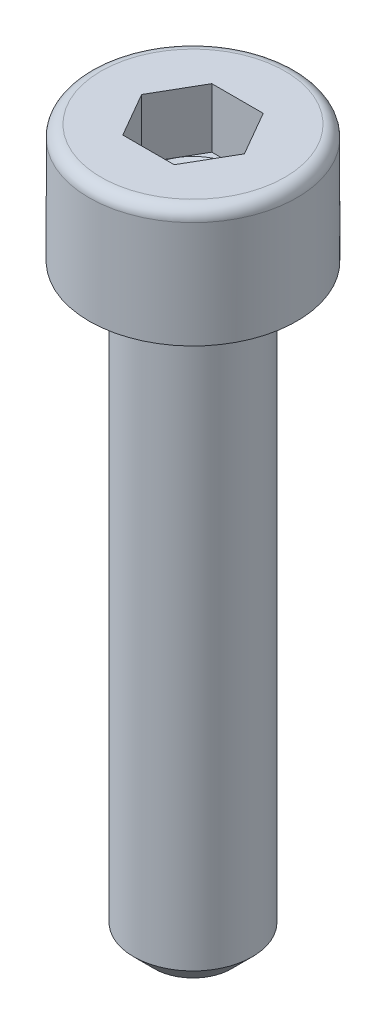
ISO-10303-21;
HEADER;
FILE_DESCRIPTION(('STEP AP214'),'2;1');
FILE_NAME('part.step','',(''),(''),'','','');
FILE_SCHEMA(('AUTOMOTIVE_DESIGN { 1 0 10303 214 1 1 1 1 }'));
ENDSEC;
DATA;
#1=APPLICATION_CONTEXT('core data for automotive mechanical design processes');
#2=APPLICATION_PROTOCOL_DEFINITION('international standard','automotive_design',2000,#1);
#3=PRODUCT_CONTEXT('',#1,'mechanical');
#4=PRODUCT('Part','Part','',(#3));
#5=PRODUCT_RELATED_PRODUCT_CATEGORY('part','',(#4));
#6=PRODUCT_DEFINITION_FORMATION('','',#4);
#7=PRODUCT_DEFINITION_CONTEXT('part definition',#1,'design');
#8=PRODUCT_DEFINITION('design','',#6,#7);
#9=PRODUCT_DEFINITION_SHAPE('','',#8);
#10=(LENGTH_UNIT() NAMED_UNIT(*) SI_UNIT(.MILLI.,.METRE.));
#11=(NAMED_UNIT(*) PLANE_ANGLE_UNIT() SI_UNIT($,.RADIAN.));
#12=(NAMED_UNIT(*) SI_UNIT($,.STERADIAN.) SOLID_ANGLE_UNIT());
#13=UNCERTAINTY_MEASURE_WITH_UNIT(LENGTH_MEASURE(1.E-05),#10,'distance_accuracy_value','');
#14=(GEOMETRIC_REPRESENTATION_CONTEXT(3) GLOBAL_UNCERTAINTY_ASSIGNED_CONTEXT((#13)) GLOBAL_UNIT_ASSIGNED_CONTEXT((#10,
#11,#12)) REPRESENTATION_CONTEXT('',''));
#15=CARTESIAN_POINT('',(0.,0.,0.));
#16=DIRECTION('',(0.,0.,1.));
#17=DIRECTION('',(1.,0.,0.));
#18=AXIS2_PLACEMENT_3D('',#15,#16,#17);
#19=CARTESIAN_POINT('',(-2.598076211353,2.,1.5));
#20=DIRECTION('',(0.,-1.,0.));
#21=DIRECTION('',(0.,0.,-1.));
#22=AXIS2_PLACEMENT_3D('',#19,#20,#21);
#23=PLANE('',#22);
#24=CARTESIAN_POINT('',(0.,2.00000000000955,0.));
#25=DIRECTION('',(0.,1.,0.));
#26=DIRECTION('',(0.,0.,1.));
#27=AXIS2_PLACEMENT_3D('',#24,#25,#26);
#28=CIRCLE('',#27,1.49999999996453);
#29=CARTESIAN_POINT('',(-1.29903810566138,2.00000000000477,-0.74999999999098));
#30=VERTEX_POINT('',#29);
#31=CARTESIAN_POINT('',(0.,2.00000000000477,-1.49999999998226));
#32=VERTEX_POINT('',#31);
#33=EDGE_CURVE('E109',#30,#32,#28,.F.);
#34=ORIENTED_EDGE('',*,*,#33,.T.);
#35=DIRECTION('',(1.,0.,0.));
#36=VECTOR('',#35,1.);
#37=CARTESIAN_POINT('',(0.8660254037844,2.,-1.5));
#38=LINE('',#37,#36);
#39=CARTESIAN_POINT('',(-0.8660254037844,2.,-1.5));
#40=VERTEX_POINT('',#39);
#41=EDGE_CURVE('E120',#40,#32,#38,.T.);
#42=ORIENTED_EDGE('',*,*,#41,.F.);
#43=DIRECTION('',(0.500000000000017,0.,-0.866025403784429));
#44=VECTOR('',#43,1.);
#45=CARTESIAN_POINT('',(-0.8660254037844,2.,-1.5));
#46=LINE('',#45,#44);
#47=EDGE_CURVE('E119',#30,#40,#46,.T.);
#48=ORIENTED_EDGE('',*,*,#47,.F.);
#49=EDGE_LOOP('',(#34,#42,#48));
#50=FACE_BOUND('',#49,.T.);
#51=ADVANCED_FACE('F17',(#50),#23,.F.);
#52=CARTESIAN_POINT('',(-2.598076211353,2.,1.5));
#53=DIRECTION('',(0.,-1.,0.));
#54=DIRECTION('',(0.,0.,-1.));
#55=AXIS2_PLACEMENT_3D('',#52,#53,#54);
#56=PLANE('',#55);
#57=CARTESIAN_POINT('',(0.,2.00000000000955,0.));
#58=DIRECTION('',(0.,1.,0.));
#59=DIRECTION('',(0.,0.,1.));
#60=AXIS2_PLACEMENT_3D('',#57,#58,#59);
#61=CIRCLE('',#60,1.49999999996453);
#62=CARTESIAN_POINT('',(-1.29903810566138,2.00000000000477,0.74999999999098));
#63=VERTEX_POINT('',#62);
#64=EDGE_CURVE('E93',#63,#30,#61,.F.);
#65=ORIENTED_EDGE('',*,*,#64,.T.);
#66=DIRECTION('',(0.500000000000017,0.,-0.866025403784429));
#67=VECTOR('',#66,1.);
#68=CARTESIAN_POINT('',(-0.8660254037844,2.,-1.5));
#69=LINE('',#68,#67);
#70=CARTESIAN_POINT('',(-1.73205080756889,2.,0.));
#71=VERTEX_POINT('',#70);
#72=EDGE_CURVE('E97',#71,#30,#69,.T.);
#73=ORIENTED_EDGE('',*,*,#72,.F.);
#74=DIRECTION('',(-0.500000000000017,0.,-0.866025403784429));
#75=VECTOR('',#74,1.);
#76=CARTESIAN_POINT('',(-0.8660254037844,2.,1.5));
#77=LINE('',#76,#75);
#78=EDGE_CURVE('E100',#63,#71,#77,.T.);
#79=ORIENTED_EDGE('',*,*,#78,.F.);
#80=EDGE_LOOP('',(#65,#73,#79));
#81=FACE_BOUND('',#80,.T.);
#82=ADVANCED_FACE('F95',(#81),#56,.F.);
#83=CARTESIAN_POINT('',(-0.8660254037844,2.,-1.5));
#84=DIRECTION('',(0.866025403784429,0.,0.500000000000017));
#85=DIRECTION('',(0.500000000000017,0.,-0.866025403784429));
#86=AXIS2_PLACEMENT_3D('',#83,#84,#85);
#87=PLANE('',#86);
#88=DIRECTION('',(0.,1.,0.));
#89=VECTOR('',#88,1.);
#90=CARTESIAN_POINT('',(-0.8660254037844,2.,-1.5));
#91=LINE('',#90,#89);
#92=CARTESIAN_POINT('',(-0.8660254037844,4.,-1.5));
#93=VERTEX_POINT('',#92);
#94=EDGE_CURVE('E138',#93,#40,#91,.F.);
#95=ORIENTED_EDGE('',*,*,#94,.F.);
#96=DIRECTION('',(0.500000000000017,0.,-0.866025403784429));
#97=VECTOR('',#96,1.);
#98=CARTESIAN_POINT('',(-0.8660254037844,4.,-1.5));
#99=LINE('',#98,#97);
#100=CARTESIAN_POINT('',(-1.7320508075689,4.,0.));
#101=VERTEX_POINT('',#100);
#102=EDGE_CURVE('E124',#93,#101,#99,.F.);
#103=ORIENTED_EDGE('',*,*,#102,.T.);
#104=DIRECTION('',(0.,1.,0.));
#105=VECTOR('',#104,1.);
#106=CARTESIAN_POINT('',(-1.73205080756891,2.,0.));
#107=LINE('',#106,#105);
#108=EDGE_CURVE('E128',#71,#101,#107,.T.);
#109=ORIENTED_EDGE('',*,*,#108,.F.);
#110=ORIENTED_EDGE('',*,*,#72,.T.);
#111=ORIENTED_EDGE('',*,*,#47,.T.);
#112=EDGE_LOOP('',(#95,#103,#109,#110,#111));
#113=FACE_BOUND('',#112,.T.);
#114=ADVANCED_FACE('F126',(#113),#87,.T.);
#115=CARTESIAN_POINT('',(0.8660254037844,2.,-1.5));
#116=DIRECTION('',(0.,0.,1.));
#117=DIRECTION('',(1.,0.,0.));
#118=AXIS2_PLACEMENT_3D('',#115,#116,#117);
#119=PLANE('',#118);
#120=DIRECTION('',(0.,1.,0.));
#121=VECTOR('',#120,1.);
#122=CARTESIAN_POINT('',(0.8660254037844,2.,-1.5));
#123=LINE('',#122,#121);
#124=CARTESIAN_POINT('',(0.8660254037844,4.,-1.5));
#125=VERTEX_POINT('',#124);
#126=CARTESIAN_POINT('',(0.8660254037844,2.,-1.5));
#127=VERTEX_POINT('',#126);
#128=EDGE_CURVE('E152',#125,#127,#123,.F.);
#129=ORIENTED_EDGE('',*,*,#128,.F.);
#130=DIRECTION('',(1.,0.,0.));
#131=VECTOR('',#130,1.);
#132=CARTESIAN_POINT('',(0.8660254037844,4.,-1.5));
#133=LINE('',#132,#131);
#134=EDGE_CURVE('E137',#125,#93,#133,.F.);
#135=ORIENTED_EDGE('',*,*,#134,.T.);
#136=ORIENTED_EDGE('',*,*,#94,.T.);
#137=ORIENTED_EDGE('',*,*,#41,.T.);
#138=DIRECTION('',(1.,0.,0.));
#139=VECTOR('',#138,1.);
#140=CARTESIAN_POINT('',(-2.598076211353,2.,-1.5));
#141=LINE('',#140,#139);
#142=EDGE_CURVE('E105',#32,#127,#141,.T.);
#143=ORIENTED_EDGE('',*,*,#142,.T.);
#144=EDGE_LOOP('',(#129,#135,#136,#137,#143));
#145=FACE_BOUND('',#144,.T.);
#146=ADVANCED_FACE('F306',(#145),#119,.T.);
#147=CARTESIAN_POINT('',(-2.598076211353,2.,1.5));
#148=DIRECTION('',(0.,-1.,0.));
#149=DIRECTION('',(0.,0.,-1.));
#150=AXIS2_PLACEMENT_3D('',#147,#148,#149);
#151=PLANE('',#150);
#152=CARTESIAN_POINT('',(0.,2.00000000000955,0.));
#153=DIRECTION('',(0.,1.,0.));
#154=DIRECTION('',(0.,0.,1.));
#155=AXIS2_PLACEMENT_3D('',#152,#153,#154);
#156=CIRCLE('',#155,1.49999999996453);
#157=CARTESIAN_POINT('',(1.29903810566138,2.00000000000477,-0.74999999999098));
#158=VERTEX_POINT('',#157);
#159=EDGE_CURVE('E114',#158,#32,#156,.T.);
#160=ORIENTED_EDGE('',*,*,#159,.F.);
#161=DIRECTION('',(0.500000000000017,0.,0.866025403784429));
#162=VECTOR('',#161,1.);
#163=CARTESIAN_POINT('',(0.8660254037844,2.,-1.5));
#164=LINE('',#163,#162);
#165=EDGE_CURVE('E245',#127,#158,#164,.T.);
#166=ORIENTED_EDGE('',*,*,#165,.F.);
#167=ORIENTED_EDGE('',*,*,#142,.F.);
#168=EDGE_LOOP('',(#160,#166,#167));
#169=FACE_BOUND('',#168,.T.);
#170=ADVANCED_FACE('F301',(#169),#151,.F.);
#171=CARTESIAN_POINT('',(0.,2.00000000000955,0.));
#172=DIRECTION('',(0.,1.,0.));
#173=DIRECTION('',(0.,0.,1.));
#174=AXIS2_PLACEMENT_3D('',#171,#172,#173);
#175=CONICAL_SURFACE('',#174,1.49999999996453,1.04719755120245);
#176=CARTESIAN_POINT('',(0.,2.00000000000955,0.));
#177=DIRECTION('',(0.,1.,0.));
#178=DIRECTION('',(0.,0.,1.));
#179=AXIS2_PLACEMENT_3D('',#176,#177,#178);
#180=CIRCLE('',#179,1.49999999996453);
#181=CARTESIAN_POINT('',(1.29903810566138,2.00000000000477,0.74999999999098));
#182=VERTEX_POINT('',#181);
#183=EDGE_CURVE('E166',#182,#158,#180,.T.);
#184=ORIENTED_EDGE('',*,*,#183,.T.);
#185=ORIENTED_EDGE('',*,*,#159,.T.);
#186=ORIENTED_EDGE('',*,*,#33,.F.);
#187=ORIENTED_EDGE('',*,*,#64,.F.);
#188=CARTESIAN_POINT('',(0.,2.00000000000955,0.));
#189=DIRECTION('',(0.,1.,0.));
#190=DIRECTION('',(0.,0.,1.));
#191=AXIS2_PLACEMENT_3D('',#188,#189,#190);
#192=CIRCLE('',#191,1.49999999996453);
#193=CARTESIAN_POINT('',(0.,2.00000000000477,1.49999999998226));
#194=VERTEX_POINT('',#193);
#195=EDGE_CURVE('E104',#63,#194,#192,.T.);
#196=ORIENTED_EDGE('',*,*,#195,.T.);
#197=CARTESIAN_POINT('',(0.,2.00000000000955,0.));
#198=DIRECTION('',(0.,1.,0.));
#199=DIRECTION('',(0.,0.,1.));
#200=AXIS2_PLACEMENT_3D('',#197,#198,#199);
#201=CIRCLE('',#200,1.49999999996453);
#202=EDGE_CURVE('E162',#194,#182,#201,.T.);
#203=ORIENTED_EDGE('',*,*,#202,.T.);
#204=EDGE_LOOP('',(#184,#185,#186,#187,#196,#203));
#205=FACE_BOUND('',#204,.T.);
#206=CARTESIAN_POINT('',(0.,1.1339745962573,0.));
#207=VERTEX_POINT('',#206);
#208=VERTEX_LOOP('',#207);
#209=FACE_BOUND('',#208,.T.);
#210=ADVANCED_FACE('F111',(#205,#209),#175,.F.);
#211=CARTESIAN_POINT('',(-2.598076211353,2.,1.5));
#212=DIRECTION('',(0.,-1.,0.));
#213=DIRECTION('',(0.,0.,-1.));
#214=AXIS2_PLACEMENT_3D('',#211,#212,#213);
#215=PLANE('',#214);
#216=ORIENTED_EDGE('',*,*,#195,.F.);
#217=DIRECTION('',(-0.500000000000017,0.,-0.866025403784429));
#218=VECTOR('',#217,1.);
#219=CARTESIAN_POINT('',(-0.8660254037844,2.,1.5));
#220=LINE('',#219,#218);
#221=CARTESIAN_POINT('',(-0.8660254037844,2.,1.5));
#222=VERTEX_POINT('',#221);
#223=EDGE_CURVE('E169',#222,#63,#220,.T.);
#224=ORIENTED_EDGE('',*,*,#223,.F.);
#225=DIRECTION('',(-1.,0.,0.));
#226=VECTOR('',#225,1.);
#227=CARTESIAN_POINT('',(0.8660254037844,2.,1.5));
#228=LINE('',#227,#226);
#229=EDGE_CURVE('E235',#194,#222,#228,.T.);
#230=ORIENTED_EDGE('',*,*,#229,.F.);
#231=EDGE_LOOP('',(#216,#224,#230));
#232=FACE_BOUND('',#231,.T.);
#233=ADVANCED_FACE('F285',(#232),#215,.F.);
#234=CARTESIAN_POINT('',(-0.8660254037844,2.,1.5));
#235=DIRECTION('',(0.866025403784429,0.,-0.500000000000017));
#236=DIRECTION('',(-0.500000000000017,0.,-0.866025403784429));
#237=AXIS2_PLACEMENT_3D('',#234,#235,#236);
#238=PLANE('',#237);
#239=ORIENTED_EDGE('',*,*,#108,.T.);
#240=DIRECTION('',(-0.500000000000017,0.,-0.866025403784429));
#241=VECTOR('',#240,1.);
#242=CARTESIAN_POINT('',(-0.8660254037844,4.,1.5));
#243=LINE('',#242,#241);
#244=CARTESIAN_POINT('',(-0.8660254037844,4.,1.5));
#245=VERTEX_POINT('',#244);
#246=EDGE_CURVE('E149',#101,#245,#243,.F.);
#247=ORIENTED_EDGE('',*,*,#246,.T.);
#248=DIRECTION('',(0.,1.,0.));
#249=VECTOR('',#248,1.);
#250=CARTESIAN_POINT('',(-0.8660254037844,2.,1.5));
#251=LINE('',#250,#249);
#252=EDGE_CURVE('E254',#222,#245,#251,.T.);
#253=ORIENTED_EDGE('',*,*,#252,.F.);
#254=ORIENTED_EDGE('',*,*,#223,.T.);
#255=ORIENTED_EDGE('',*,*,#78,.T.);
#256=EDGE_LOOP('',(#239,#247,#253,#254,#255));
#257=FACE_BOUND('',#256,.T.);
#258=ADVANCED_FACE('F279',(#257),#238,.T.);
#259=CARTESIAN_POINT('',(0.8660254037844,2.,-1.5));
#260=DIRECTION('',(-0.866025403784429,0.,0.500000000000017));
#261=DIRECTION('',(0.500000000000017,0.,0.866025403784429));
#262=AXIS2_PLACEMENT_3D('',#259,#260,#261);
#263=PLANE('',#262);
#264=DIRECTION('',(0.,1.,0.));
#265=VECTOR('',#264,1.);
#266=CARTESIAN_POINT('',(1.73205080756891,2.,0.));
#267=LINE('',#266,#265);
#268=CARTESIAN_POINT('',(1.73205080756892,4.,0.));
#269=VERTEX_POINT('',#268);
#270=CARTESIAN_POINT('',(1.73205080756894,2.,0.));
#271=VERTEX_POINT('',#270);
#272=EDGE_CURVE('E221',#269,#271,#267,.F.);
#273=ORIENTED_EDGE('',*,*,#272,.F.);
#274=DIRECTION('',(0.500000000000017,0.,0.866025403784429));
#275=VECTOR('',#274,1.);
#276=CARTESIAN_POINT('',(0.8660254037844,4.,-1.5));
#277=LINE('',#276,#275);
#278=EDGE_CURVE('E168',#269,#125,#277,.F.);
#279=ORIENTED_EDGE('',*,*,#278,.T.);
#280=ORIENTED_EDGE('',*,*,#128,.T.);
#281=ORIENTED_EDGE('',*,*,#165,.T.);
#282=DIRECTION('',(0.49999999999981,0.,0.866025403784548));
#283=VECTOR('',#282,1.);
#284=CARTESIAN_POINT('',(1.299038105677,2.,-0.75));
#285=LINE('',#284,#283);
#286=EDGE_CURVE('E165',#158,#271,#285,.T.);
#287=ORIENTED_EDGE('',*,*,#286,.T.);
#288=EDGE_LOOP('',(#273,#279,#280,#281,#287));
#289=FACE_BOUND('',#288,.T.);
#290=ADVANCED_FACE('F303',(#289),#263,.T.);
#291=CARTESIAN_POINT('',(-2.598076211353,2.,1.5));
#292=DIRECTION('',(0.,-1.,0.));
#293=DIRECTION('',(0.,0.,-1.));
#294=AXIS2_PLACEMENT_3D('',#291,#292,#293);
#295=PLANE('',#294);
#296=ORIENTED_EDGE('',*,*,#286,.F.);
#297=ORIENTED_EDGE('',*,*,#183,.F.);
#298=DIRECTION('',(-0.500000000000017,0.,0.866025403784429));
#299=VECTOR('',#298,1.);
#300=CARTESIAN_POINT('',(0.8660254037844,2.,1.5));
#301=LINE('',#300,#299);
#302=EDGE_CURVE('E212',#271,#182,#301,.T.);
#303=ORIENTED_EDGE('',*,*,#302,.F.);
#304=EDGE_LOOP('',(#296,#297,#303));
#305=FACE_BOUND('',#304,.T.);
#306=ADVANCED_FACE('F297',(#305),#295,.F.);
#307=CARTESIAN_POINT('',(-2.598076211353,2.,1.5));
#308=DIRECTION('',(0.,-1.,0.));
#309=DIRECTION('',(0.,0.,-1.));
#310=AXIS2_PLACEMENT_3D('',#307,#308,#309);
#311=PLANE('',#310);
#312=ORIENTED_EDGE('',*,*,#202,.F.);
#313=DIRECTION('',(-1.,0.,0.));
#314=VECTOR('',#313,1.);
#315=CARTESIAN_POINT('',(0.8660254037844,2.,1.5));
#316=LINE('',#315,#314);
#317=CARTESIAN_POINT('',(0.8660254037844,2.,1.5));
#318=VERTEX_POINT('',#317);
#319=EDGE_CURVE('E164',#318,#194,#316,.T.);
#320=ORIENTED_EDGE('',*,*,#319,.F.);
#321=DIRECTION('',(-0.500000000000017,0.,0.866025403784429));
#322=VECTOR('',#321,1.);
#323=CARTESIAN_POINT('',(0.8660254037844,2.,1.5));
#324=LINE('',#323,#322);
#325=EDGE_CURVE('E220',#182,#318,#324,.T.);
#326=ORIENTED_EDGE('',*,*,#325,.F.);
#327=EDGE_LOOP('',(#312,#320,#326));
#328=FACE_BOUND('',#327,.T.);
#329=ADVANCED_FACE('F290',(#328),#311,.F.);
#330=CARTESIAN_POINT('',(0.8660254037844,2.,1.5));
#331=DIRECTION('',(0.,0.,-1.));
#332=DIRECTION('',(-1.,0.,0.));
#333=AXIS2_PLACEMENT_3D('',#330,#331,#332);
#334=PLANE('',#333);
#335=ORIENTED_EDGE('',*,*,#252,.T.);
#336=DIRECTION('',(-1.,0.,0.));
#337=VECTOR('',#336,1.);
#338=CARTESIAN_POINT('',(0.8660254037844,4.,1.5));
#339=LINE('',#338,#337);
#340=CARTESIAN_POINT('',(0.8660254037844,4.,1.5));
#341=VERTEX_POINT('',#340);
#342=EDGE_CURVE('E240',#245,#341,#339,.F.);
#343=ORIENTED_EDGE('',*,*,#342,.T.);
#344=DIRECTION('',(0.,1.,0.));
#345=VECTOR('',#344,1.);
#346=CARTESIAN_POINT('',(0.8660254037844,2.,1.5));
#347=LINE('',#346,#345);
#348=EDGE_CURVE('E226',#318,#341,#347,.T.);
#349=ORIENTED_EDGE('',*,*,#348,.F.);
#350=ORIENTED_EDGE('',*,*,#319,.T.);
#351=ORIENTED_EDGE('',*,*,#229,.T.);
#352=EDGE_LOOP('',(#335,#343,#349,#350,#351));
#353=FACE_BOUND('',#352,.T.);
#354=ADVANCED_FACE('F316',(#353),#334,.T.);
#355=CARTESIAN_POINT('',(0.8660254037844,2.,1.5));
#356=DIRECTION('',(-0.866025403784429,0.,-0.500000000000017));
#357=DIRECTION('',(-0.500000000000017,0.,0.866025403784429));
#358=AXIS2_PLACEMENT_3D('',#355,#356,#357);
#359=PLANE('',#358);
#360=ORIENTED_EDGE('',*,*,#348,.T.);
#361=DIRECTION('',(0.50000000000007,0.,-0.866025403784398));
#362=VECTOR('',#361,1.);
#363=CARTESIAN_POINT('',(0.8660254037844,4.,1.5));
#364=LINE('',#363,#362);
#365=EDGE_CURVE('E176',#341,#269,#364,.T.);
#366=ORIENTED_EDGE('',*,*,#365,.T.);
#367=ORIENTED_EDGE('',*,*,#272,.T.);
#368=ORIENTED_EDGE('',*,*,#302,.T.);
#369=ORIENTED_EDGE('',*,*,#325,.T.);
#370=EDGE_LOOP('',(#360,#366,#367,#368,#369));
#371=FACE_BOUND('',#370,.T.);
#372=ADVANCED_FACE('F197',(#371),#359,.T.);
#373=CARTESIAN_POINT('',(1.5,4.,0.));
#374=DIRECTION('',(0.,-1.,0.));
#375=DIRECTION('',(0.,0.,-1.));
#376=AXIS2_PLACEMENT_3D('',#373,#374,#375);
#377=PLANE('',#376);
#378=ORIENTED_EDGE('',*,*,#342,.F.);
#379=ORIENTED_EDGE('',*,*,#246,.F.);
#380=ORIENTED_EDGE('',*,*,#102,.F.);
#381=ORIENTED_EDGE('',*,*,#134,.F.);
#382=ORIENTED_EDGE('',*,*,#278,.F.);
#383=ORIENTED_EDGE('',*,*,#365,.F.);
#384=EDGE_LOOP('',(#378,#379,#380,#381,#382,#383));
#385=FACE_BOUND('',#384,.T.);
#386=CARTESIAN_POINT('',(0.,4.,0.));
#387=DIRECTION('',(0.,-1.,0.));
#388=DIRECTION('',(1.,0.,0.));
#389=AXIS2_PLACEMENT_3D('',#386,#387,#388);
#390=CIRCLE('',#389,3.1);
#391=CARTESIAN_POINT('',(3.1,4.,0.));
#392=VERTEX_POINT('',#391);
#393=CARTESIAN_POINT('',(-3.1,4.,0.));
#394=VERTEX_POINT('',#393);
#395=EDGE_CURVE('E37',#392,#394,#390,.T.);
#396=ORIENTED_EDGE('',*,*,#395,.F.);
#397=CARTESIAN_POINT('',(0.,4.,0.));
#398=DIRECTION('',(0.,-1.,0.));
#399=DIRECTION('',(-1.,0.,0.));
#400=AXIS2_PLACEMENT_3D('',#397,#398,#399);
#401=CIRCLE('',#400,3.1);
#402=EDGE_CURVE('E174',#394,#392,#401,.T.);
#403=ORIENTED_EDGE('',*,*,#402,.F.);
#404=EDGE_LOOP('',(#396,#403));
#405=FACE_BOUND('',#404,.T.);
#406=ADVANCED_FACE('F178',(#385,#405),#377,.F.);
#407=CARTESIAN_POINT('',(0.,3.6,0.));
#408=DIRECTION('',(0.,1.,0.));
#409=DIRECTION('',(-1.,0.,0.));
#410=AXIS2_PLACEMENT_3D('',#407,#408,#409);
#411=TOROIDAL_SURFACE('',#410,3.1,0.4);
#412=ORIENTED_EDGE('',*,*,#395,.T.);
#413=ORIENTED_EDGE('',*,*,#402,.T.);
#414=EDGE_LOOP('',(#412,#413));
#415=FACE_BOUND('',#414,.T.);
#416=CARTESIAN_POINT('',(0.,3.6,0.));
#417=DIRECTION('',(0.,1.,0.));
#418=DIRECTION('',(0.,0.,1.));
#419=AXIS2_PLACEMENT_3D('',#416,#417,#418);
#420=CIRCLE('',#419,3.5);
#421=CARTESIAN_POINT('',(0.,3.6,3.5));
#422=VERTEX_POINT('',#421);
#423=EDGE_CURVE('E161',#422,#422,#420,.F.);
#424=ORIENTED_EDGE('',*,*,#423,.F.);
#425=EDGE_LOOP('',(#424));
#426=FACE_BOUND('',#425,.T.);
#427=ADVANCED_FACE('F172',(#415,#426),#411,.T.);
#428=CARTESIAN_POINT('',(0.,-20.,0.));
#429=DIRECTION('',(0.,1.,0.));
#430=DIRECTION('',(0.,0.,1.));
#431=AXIS2_PLACEMENT_3D('',#428,#429,#430);
#432=PLANE('',#431);
#433=CARTESIAN_POINT('',(0.,-20.0000000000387,0.));
#434=DIRECTION('',(0.,1.,0.));
#435=DIRECTION('',(0.,0.,1.));
#436=AXIS2_PLACEMENT_3D('',#433,#434,#435);
#437=CIRCLE('',#436,1.29999999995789);
#438=CARTESIAN_POINT('',(0.,-20.0000000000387,1.29999999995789));
#439=VERTEX_POINT('',#438);
#440=EDGE_CURVE('E158',#439,#439,#437,.T.);
#441=ORIENTED_EDGE('',*,*,#440,.F.);
#442=EDGE_LOOP('',(#441));
#443=FACE_BOUND('',#442,.T.);
#444=ADVANCED_FACE('F204',(#443),#432,.F.);
#445=CARTESIAN_POINT('',(0.,4.,0.));
#446=DIRECTION('',(0.,1.,0.));
#447=DIRECTION('',(0.,0.,1.));
#448=AXIS2_PLACEMENT_3D('',#445,#446,#447);
#449=CYLINDRICAL_SURFACE('',#448,3.5);
#450=ORIENTED_EDGE('',*,*,#423,.T.);
#451=EDGE_LOOP('',(#450));
#452=FACE_BOUND('',#451,.T.);
#453=CARTESIAN_POINT('',(0.,0.,0.));
#454=DIRECTION('',(0.,1.,0.));
#455=DIRECTION('',(0.,0.,1.));
#456=AXIS2_PLACEMENT_3D('',#453,#454,#455);
#457=CIRCLE('',#456,3.5);
#458=CARTESIAN_POINT('',(0.,0.,3.5));
#459=VERTEX_POINT('',#458);
#460=EDGE_CURVE('E155',#459,#459,#457,.T.);
#461=ORIENTED_EDGE('',*,*,#460,.T.);
#462=EDGE_LOOP('',(#461));
#463=FACE_BOUND('',#462,.T.);
#464=ADVANCED_FACE('F342',(#452,#463),#449,.T.);
#465=CARTESIAN_POINT('',(0.,-19.299999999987,0.));
#466=DIRECTION('',(0.,1.,0.));
#467=DIRECTION('',(0.,0.,1.));
#468=AXIS2_PLACEMENT_3D('',#465,#466,#467);
#469=CONICAL_SURFACE('',#468,1.99999999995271,0.785398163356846);
#470=CARTESIAN_POINT('',(0.,-19.3,0.));
#471=DIRECTION('',(0.,1.,0.));
#472=DIRECTION('',(0.,0.,1.));
#473=AXIS2_PLACEMENT_3D('',#470,#471,#472);
#474=CIRCLE('',#473,2.);
#475=CARTESIAN_POINT('',(0.,-19.3,2.));
#476=VERTEX_POINT('',#475);
#477=EDGE_CURVE('E29',#476,#476,#474,.T.);
#478=ORIENTED_EDGE('',*,*,#477,.F.);
#479=EDGE_LOOP('',(#478));
#480=FACE_BOUND('',#479,.T.);
#481=ORIENTED_EDGE('',*,*,#440,.T.);
#482=EDGE_LOOP('',(#481));
#483=FACE_BOUND('',#482,.T.);
#484=ADVANCED_FACE('F332',(#480,#483),#469,.T.);
#485=CARTESIAN_POINT('',(0.,0.,0.));
#486=DIRECTION('',(0.,1.,0.));
#487=DIRECTION('',(0.,0.,1.));
#488=AXIS2_PLACEMENT_3D('',#485,#486,#487);
#489=PLANE('',#488);
#490=CARTESIAN_POINT('',(0.,0.,0.));
#491=DIRECTION('',(0.,1.,0.));
#492=DIRECTION('',(0.,0.,1.));
#493=AXIS2_PLACEMENT_3D('',#490,#491,#492);
#494=CIRCLE('',#493,2.);
#495=CARTESIAN_POINT('',(0.,0.,2.));
#496=VERTEX_POINT('',#495);
#497=EDGE_CURVE('E11',#496,#496,#494,.F.);
#498=ORIENTED_EDGE('',*,*,#497,.F.);
#499=EDGE_LOOP('',(#498));
#500=FACE_BOUND('',#499,.T.);
#501=ORIENTED_EDGE('',*,*,#460,.F.);
#502=EDGE_LOOP('',(#501));
#503=FACE_BOUND('',#502,.T.);
#504=ADVANCED_FACE('F327',(#500,#503),#489,.F.);
#505=CARTESIAN_POINT('',(0.,-20.,0.));
#506=DIRECTION('',(0.,1.,0.));
#507=DIRECTION('',(0.,0.,1.));
#508=AXIS2_PLACEMENT_3D('',#505,#506,#507);
#509=CYLINDRICAL_SURFACE('',#508,2.);
#510=ORIENTED_EDGE('',*,*,#497,.T.);
#511=EDGE_LOOP('',(#510));
#512=FACE_BOUND('',#511,.T.);
#513=ORIENTED_EDGE('',*,*,#477,.T.);
#514=EDGE_LOOP('',(#513));
#515=FACE_BOUND('',#514,.T.);
#516=ADVANCED_FACE('F19',(#512,#515),#509,.T.);
#517=CLOSED_SHELL('',(#51,#82,#114,#146,#170,#210,#233,#258,#290,#306,#329,#354,#372,#406,#427,
#444,#464,#484,#504,#516));
#518=MANIFOLD_SOLID_BREP('B1',#517);
#519=ADVANCED_BREP_SHAPE_REPRESENTATION('',(#18,#518),#14);
#520=SHAPE_DEFINITION_REPRESENTATION(#9,#519);
ENDSEC;
END-ISO-10303-21;
